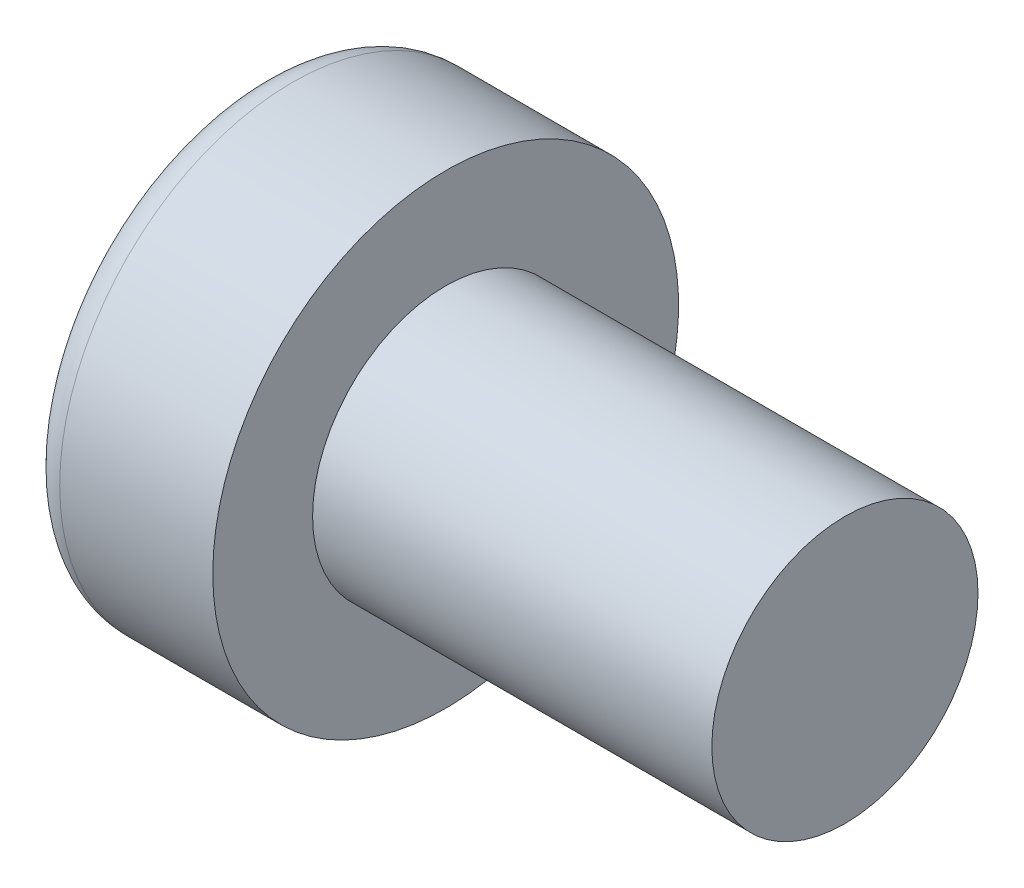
from build123d import *

# Parameters (mm, degrees)
VERRUNDUNG1_R                   = 0.5
SCHNITT_LINEAR_AUSTRAGEN1_DEPTH = 3


with BuildPart() as part:
    # Skizze1 → Rotation1 (revolve)
    with BuildSketch(Plane.XY, mode=Mode.PRIVATE) as rotation1_sk:
        Polygon((-8.8, 0), (-8.8, 3.5), (-6, 3.5), (-6, 2), (0, 2), (0, 0), align=None)
    revolve(rotation1_sk.sketch.rotate(Axis((-65.011808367, 0, 0), (1, 0, 0)), 90), axis=Axis((-65.011808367, 0, 0), (1, 0, 0)))

    # Verrundung1
    verrundung1_edges = [part.edges().sort_by_distance(p)[0] for p in [
        (-8.8, 0, -3.5),
    ]]
    fillet(verrundung1_edges, radius=VERRUNDUNG1_R)

    # Skizze2 → Schnitt-Linear austragen1 (cut)
    with BuildSketch(Plane.ZY.offset(8.8)):
        Polygon((1.5, 0.866025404), (0, 1.732050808), (-1.5, 0.866025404), (-1.5, -0.866025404), (0, -1.732050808), (1.5, -0.866025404), align=None)
    extrude(amount=-SCHNITT_LINEAR_AUSTRAGEN1_DEPTH, mode=Mode.SUBTRACT)


solid = part.part
